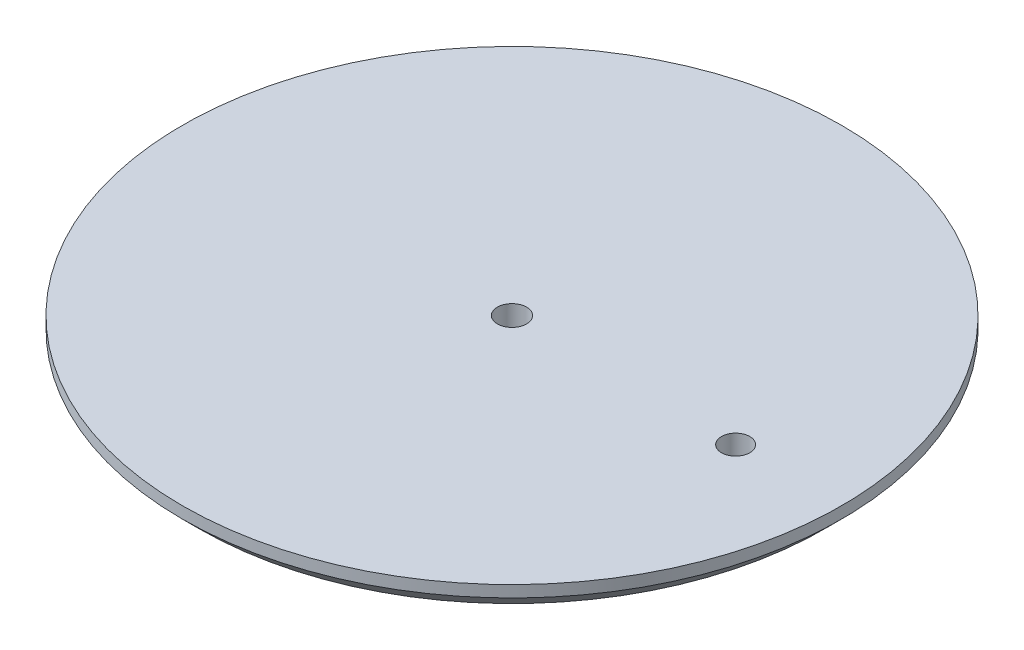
from build123d import *

# Parameters (mm, degrees)
ESQUISSE2_R             = 3.1
ESQUISSE2_R_2           = 3
ENL_V_MAT_EXTRU_1_DEPTH = 100.176610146


with BuildPart() as part:
    # Esquisse1 → R_volution1 (revolve)
    with BuildSketch(Plane.XY, mode=Mode.PRIVATE) as r_volution1_sk:
        Polygon((35, 6), (0, 6), (0, 0), (31.464466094, 0), (66.464466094, 0), (70, 3.535533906), (70, 6), align=None)
    revolve(r_volution1_sk.sketch.rotate(Axis((0, 18.075916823, 0), (0, -1, 0)), 90), axis=Axis((0, 18.075916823, 0), (0, -1, 0)))

    # Esquisse2 → Enl_v. mat.-Extru.1 (cut, through all)
    with BuildSketch(Plane(origin=(0, 6, 0), x_dir=(-1, 0, 0), z_dir=(0, 1, 0))):
        with Locations(Location((0, 0, 0), (0, 0, 90))):
            Circle(ESQUISSE2_R)
        with Locations(Location((-47.5, 0, 0), (0, 0, 90))):
            Circle(ESQUISSE2_R_2)
    extrude(amount=-ENL_V_MAT_EXTRU_1_DEPTH, mode=Mode.SUBTRACT)


solid = part.part
